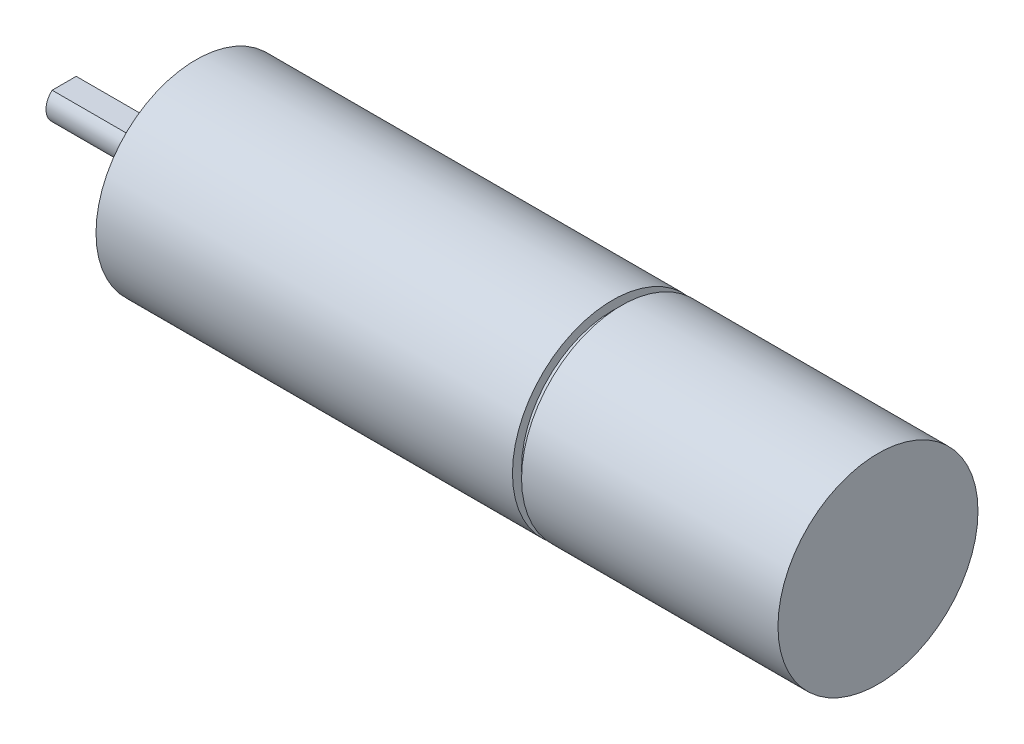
ISO-10303-21;
HEADER;
FILE_DESCRIPTION(('STEP AP214'),'2;1');
FILE_NAME('part.step','',(''),(''),'','','');
FILE_SCHEMA(('AUTOMOTIVE_DESIGN { 1 0 10303 214 1 1 1 1 }'));
ENDSEC;
DATA;
#1=APPLICATION_CONTEXT('core data for automotive mechanical design processes');
#2=APPLICATION_PROTOCOL_DEFINITION('international standard','automotive_design',2000,#1);
#3=PRODUCT_CONTEXT('',#1,'mechanical');
#4=PRODUCT('Part','Part','',(#3));
#5=PRODUCT_RELATED_PRODUCT_CATEGORY('part','',(#4));
#6=PRODUCT_DEFINITION_FORMATION('','',#4);
#7=PRODUCT_DEFINITION_CONTEXT('part definition',#1,'design');
#8=PRODUCT_DEFINITION('design','',#6,#7);
#9=PRODUCT_DEFINITION_SHAPE('','',#8);
#10=(LENGTH_UNIT() NAMED_UNIT(*) SI_UNIT(.MILLI.,.METRE.));
#11=(NAMED_UNIT(*) PLANE_ANGLE_UNIT() SI_UNIT($,.RADIAN.));
#12=(NAMED_UNIT(*) SI_UNIT($,.STERADIAN.) SOLID_ANGLE_UNIT());
#13=UNCERTAINTY_MEASURE_WITH_UNIT(LENGTH_MEASURE(1.E-05),#10,'distance_accuracy_value','');
#14=(GEOMETRIC_REPRESENTATION_CONTEXT(3) GLOBAL_UNCERTAINTY_ASSIGNED_CONTEXT((#13)) GLOBAL_UNIT_ASSIGNED_CONTEXT((#10,
#11,#12)) REPRESENTATION_CONTEXT('',''));
#15=CARTESIAN_POINT('',(0.,0.,0.));
#16=DIRECTION('',(0.,0.,1.));
#17=DIRECTION('',(1.,0.,0.));
#18=AXIS2_PLACEMENT_3D('',#15,#16,#17);
#19=CARTESIAN_POINT('',(29.2,0.,-11.));
#20=DIRECTION('',(1.,0.,0.));
#21=DIRECTION('',(0.,0.,-1.));
#22=AXIS2_PLACEMENT_3D('',#19,#20,#21);
#23=PLANE('',#22);
#24=CARTESIAN_POINT('',(29.2,0.,0.));
#25=DIRECTION('',(1.,0.,0.));
#26=DIRECTION('',(0.,0.,-1.));
#27=AXIS2_PLACEMENT_3D('',#24,#25,#26);
#28=CIRCLE('',#27,11.);
#29=CARTESIAN_POINT('',(29.2,0.,-11.));
#30=VERTEX_POINT('',#29);
#31=EDGE_CURVE('E37',#30,#30,#28,.T.);
#32=ORIENTED_EDGE('',*,*,#31,.T.);
#33=EDGE_LOOP('',(#32));
#34=FACE_BOUND('',#33,.T.);
#35=ADVANCED_FACE('F30',(#34),#23,.T.);
#36=CARTESIAN_POINT('',(0.,0.,0.));
#37=DIRECTION('',(1.,0.,0.));
#38=DIRECTION('',(0.,0.,-1.));
#39=AXIS2_PLACEMENT_3D('',#36,#37,#38);
#40=CYLINDRICAL_SURFACE('',#39,11.);
#41=CARTESIAN_POINT('',(1.,0.,0.));
#42=DIRECTION('',(1.,0.,0.));
#43=DIRECTION('',(0.,0.,-1.));
#44=AXIS2_PLACEMENT_3D('',#41,#42,#43);
#45=CIRCLE('',#44,11.);
#46=CARTESIAN_POINT('',(1.,0.,-11.));
#47=VERTEX_POINT('',#46);
#48=EDGE_CURVE('E122',#47,#47,#45,.T.);
#49=ORIENTED_EDGE('',*,*,#48,.T.);
#50=EDGE_LOOP('',(#49));
#51=FACE_BOUND('',#50,.T.);
#52=ORIENTED_EDGE('',*,*,#31,.F.);
#53=EDGE_LOOP('',(#52));
#54=FACE_BOUND('',#53,.T.);
#55=ADVANCED_FACE('F128',(#51,#54),#40,.T.);
#56=CARTESIAN_POINT('',(1.,0.,-10.));
#57=DIRECTION('',(-1.,0.,0.));
#58=DIRECTION('',(0.,0.,1.));
#59=AXIS2_PLACEMENT_3D('',#56,#57,#58);
#60=PLANE('',#59);
#61=CARTESIAN_POINT('',(1.,0.,0.));
#62=DIRECTION('',(1.,0.,0.));
#63=DIRECTION('',(0.,0.,-1.));
#64=AXIS2_PLACEMENT_3D('',#61,#62,#63);
#65=CIRCLE('',#64,10.);
#66=CARTESIAN_POINT('',(1.,0.,-10.));
#67=VERTEX_POINT('',#66);
#68=EDGE_CURVE('E119',#67,#67,#65,.T.);
#69=ORIENTED_EDGE('',*,*,#68,.T.);
#70=EDGE_LOOP('',(#69));
#71=FACE_BOUND('',#70,.T.);
#72=ORIENTED_EDGE('',*,*,#48,.F.);
#73=EDGE_LOOP('',(#72));
#74=FACE_BOUND('',#73,.T.);
#75=ADVANCED_FACE('F130',(#71,#74),#60,.T.);
#76=CARTESIAN_POINT('',(0.,0.,0.));
#77=DIRECTION('',(1.,0.,0.));
#78=DIRECTION('',(0.,0.,-1.));
#79=AXIS2_PLACEMENT_3D('',#76,#77,#78);
#80=CYLINDRICAL_SURFACE('',#79,10.);
#81=CARTESIAN_POINT('',(0.,0.,0.));
#82=DIRECTION('',(1.,0.,0.));
#83=DIRECTION('',(0.,0.,-1.));
#84=AXIS2_PLACEMENT_3D('',#81,#82,#83);
#85=CIRCLE('',#84,10.);
#86=CARTESIAN_POINT('',(0.,0.,-10.));
#87=VERTEX_POINT('',#86);
#88=EDGE_CURVE('E116',#87,#87,#85,.T.);
#89=ORIENTED_EDGE('',*,*,#88,.T.);
#90=EDGE_LOOP('',(#89));
#91=FACE_BOUND('',#90,.T.);
#92=ORIENTED_EDGE('',*,*,#68,.F.);
#93=EDGE_LOOP('',(#92));
#94=FACE_BOUND('',#93,.T.);
#95=ADVANCED_FACE('F136',(#91,#94),#80,.T.);
#96=CARTESIAN_POINT('',(0.,0.,-11.));
#97=DIRECTION('',(1.,0.,0.));
#98=DIRECTION('',(0.,0.,-1.));
#99=AXIS2_PLACEMENT_3D('',#96,#97,#98);
#100=PLANE('',#99);
#101=CARTESIAN_POINT('',(0.,0.,0.));
#102=DIRECTION('',(1.,0.,0.));
#103=DIRECTION('',(0.,0.,-1.));
#104=AXIS2_PLACEMENT_3D('',#101,#102,#103);
#105=CIRCLE('',#104,11.);
#106=CARTESIAN_POINT('',(0.,0.,-11.));
#107=VERTEX_POINT('',#106);
#108=EDGE_CURVE('E113',#107,#107,#105,.T.);
#109=ORIENTED_EDGE('',*,*,#108,.T.);
#110=EDGE_LOOP('',(#109));
#111=FACE_BOUND('',#110,.T.);
#112=ORIENTED_EDGE('',*,*,#88,.F.);
#113=EDGE_LOOP('',(#112));
#114=FACE_BOUND('',#113,.T.);
#115=ADVANCED_FACE('F142',(#111,#114),#100,.T.);
#116=CARTESIAN_POINT('',(0.,0.,0.));
#117=DIRECTION('',(1.,0.,0.));
#118=DIRECTION('',(0.,0.,-1.));
#119=AXIS2_PLACEMENT_3D('',#116,#117,#118);
#120=CYLINDRICAL_SURFACE('',#119,11.);
#121=CARTESIAN_POINT('',(-45.8,0.,0.));
#122=DIRECTION('',(1.,0.,0.));
#123=DIRECTION('',(0.,0.,-1.));
#124=AXIS2_PLACEMENT_3D('',#121,#122,#123);
#125=CIRCLE('',#124,11.);
#126=CARTESIAN_POINT('',(-45.8,0.,-11.));
#127=VERTEX_POINT('',#126);
#128=EDGE_CURVE('E110',#127,#127,#125,.T.);
#129=ORIENTED_EDGE('',*,*,#128,.T.);
#130=EDGE_LOOP('',(#129));
#131=FACE_BOUND('',#130,.T.);
#132=ORIENTED_EDGE('',*,*,#108,.F.);
#133=EDGE_LOOP('',(#132));
#134=FACE_BOUND('',#133,.T.);
#135=ADVANCED_FACE('F146',(#131,#134),#120,.T.);
#136=CARTESIAN_POINT('',(-45.8,0.,-4.99999999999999));
#137=DIRECTION('',(-1.,0.,0.));
#138=DIRECTION('',(0.,0.,1.));
#139=AXIS2_PLACEMENT_3D('',#136,#137,#138);
#140=PLANE('',#139);
#141=CARTESIAN_POINT('',(-45.8,7.,0.));
#142=DIRECTION('',(-1.,0.,0.));
#143=DIRECTION('',(0.,0.,1.));
#144=AXIS2_PLACEMENT_3D('',#141,#142,#143);
#145=CIRCLE('',#144,1.025);
#146=CARTESIAN_POINT('',(-45.8,7.,1.025));
#147=VERTEX_POINT('',#146);
#148=EDGE_CURVE('E70',#147,#147,#145,.T.);
#149=ORIENTED_EDGE('',*,*,#148,.F.);
#150=EDGE_LOOP('',(#149));
#151=FACE_BOUND('',#150,.T.);
#152=CARTESIAN_POINT('',(-45.8,-3.50000000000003,6.06217782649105));
#153=DIRECTION('',(-1.,0.,0.));
#154=DIRECTION('',(0.,0.,1.));
#155=AXIS2_PLACEMENT_3D('',#152,#153,#154);
#156=CIRCLE('',#155,1.025);
#157=CARTESIAN_POINT('',(-45.8,-3.50000000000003,7.08717782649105));
#158=VERTEX_POINT('',#157);
#159=EDGE_CURVE('E78',#158,#158,#156,.T.);
#160=ORIENTED_EDGE('',*,*,#159,.F.);
#161=EDGE_LOOP('',(#160));
#162=FACE_BOUND('',#161,.T.);
#163=CARTESIAN_POINT('',(-45.8,-3.50000000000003,-6.06217782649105));
#164=DIRECTION('',(-1.,0.,0.));
#165=DIRECTION('',(0.,0.,1.));
#166=AXIS2_PLACEMENT_3D('',#163,#164,#165);
#167=CIRCLE('',#166,1.025);
#168=CARTESIAN_POINT('',(-45.8,-3.50000000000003,-5.03717782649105));
#169=VERTEX_POINT('',#168);
#170=EDGE_CURVE('E84',#169,#169,#167,.T.);
#171=ORIENTED_EDGE('',*,*,#170,.F.);
#172=EDGE_LOOP('',(#171));
#173=FACE_BOUND('',#172,.T.);
#174=CARTESIAN_POINT('',(-45.8,0.,0.));
#175=DIRECTION('',(1.,0.,0.));
#176=DIRECTION('',(0.,0.,-1.));
#177=AXIS2_PLACEMENT_3D('',#174,#175,#176);
#178=CIRCLE('',#177,4.99999999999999);
#179=CARTESIAN_POINT('',(-45.8,0.,-4.99999999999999));
#180=VERTEX_POINT('',#179);
#181=EDGE_CURVE('E107',#180,#180,#178,.T.);
#182=ORIENTED_EDGE('',*,*,#181,.T.);
#183=EDGE_LOOP('',(#182));
#184=FACE_BOUND('',#183,.T.);
#185=ORIENTED_EDGE('',*,*,#128,.F.);
#186=EDGE_LOOP('',(#185));
#187=FACE_BOUND('',#186,.T.);
#188=ADVANCED_FACE('F150',(#151,#162,#173,#184,#187),#140,.T.);
#189=CARTESIAN_POINT('',(0.,0.,0.));
#190=DIRECTION('',(1.,0.,0.));
#191=DIRECTION('',(0.,0.,-1.));
#192=AXIS2_PLACEMENT_3D('',#189,#190,#191);
#193=CYLINDRICAL_SURFACE('',#192,4.99999999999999);
#194=CARTESIAN_POINT('',(-47.1,0.,0.));
#195=DIRECTION('',(1.,0.,0.));
#196=DIRECTION('',(0.,0.,-1.));
#197=AXIS2_PLACEMENT_3D('',#194,#195,#196);
#198=CIRCLE('',#197,4.99999999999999);
#199=CARTESIAN_POINT('',(-47.1,0.,-4.99999999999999));
#200=VERTEX_POINT('',#199);
#201=EDGE_CURVE('E104',#200,#200,#198,.T.);
#202=ORIENTED_EDGE('',*,*,#201,.T.);
#203=EDGE_LOOP('',(#202));
#204=FACE_BOUND('',#203,.T.);
#205=ORIENTED_EDGE('',*,*,#181,.F.);
#206=EDGE_LOOP('',(#205));
#207=FACE_BOUND('',#206,.T.);
#208=ADVANCED_FACE('F154',(#204,#207),#193,.T.);
#209=CARTESIAN_POINT('',(-47.1,0.,-3.49999999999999));
#210=DIRECTION('',(-1.,0.,0.));
#211=DIRECTION('',(0.,0.,1.));
#212=AXIS2_PLACEMENT_3D('',#209,#210,#211);
#213=PLANE('',#212);
#214=CARTESIAN_POINT('',(-47.1,0.,0.));
#215=DIRECTION('',(1.,0.,0.));
#216=DIRECTION('',(0.,0.,-1.));
#217=AXIS2_PLACEMENT_3D('',#214,#215,#216);
#218=CIRCLE('',#217,3.49999999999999);
#219=CARTESIAN_POINT('',(-47.1,0.,-3.49999999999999));
#220=VERTEX_POINT('',#219);
#221=EDGE_CURVE('E101',#220,#220,#218,.T.);
#222=ORIENTED_EDGE('',*,*,#221,.T.);
#223=EDGE_LOOP('',(#222));
#224=FACE_BOUND('',#223,.T.);
#225=ORIENTED_EDGE('',*,*,#201,.F.);
#226=EDGE_LOOP('',(#225));
#227=FACE_BOUND('',#226,.T.);
#228=ADVANCED_FACE('F158',(#224,#227),#213,.T.);
#229=CARTESIAN_POINT('',(0.,0.,0.));
#230=DIRECTION('',(1.,0.,0.));
#231=DIRECTION('',(0.,0.,-1.));
#232=AXIS2_PLACEMENT_3D('',#229,#230,#231);
#233=CYLINDRICAL_SURFACE('',#232,3.49999999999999);
#234=CARTESIAN_POINT('',(-48.95,0.,0.));
#235=DIRECTION('',(1.,0.,0.));
#236=DIRECTION('',(0.,0.,-1.));
#237=AXIS2_PLACEMENT_3D('',#234,#235,#236);
#238=CIRCLE('',#237,3.49999999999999);
#239=CARTESIAN_POINT('',(-48.95,0.,-3.49999999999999));
#240=VERTEX_POINT('',#239);
#241=EDGE_CURVE('E98',#240,#240,#238,.T.);
#242=ORIENTED_EDGE('',*,*,#241,.T.);
#243=EDGE_LOOP('',(#242));
#244=FACE_BOUND('',#243,.T.);
#245=ORIENTED_EDGE('',*,*,#221,.F.);
#246=EDGE_LOOP('',(#245));
#247=FACE_BOUND('',#246,.T.);
#248=ADVANCED_FACE('F162',(#244,#247),#233,.T.);
#249=CARTESIAN_POINT('',(-48.95,0.,-1.99999999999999));
#250=DIRECTION('',(-1.,0.,0.));
#251=DIRECTION('',(0.,0.,1.));
#252=AXIS2_PLACEMENT_3D('',#249,#250,#251);
#253=PLANE('',#252);
#254=CARTESIAN_POINT('',(-48.95,0.,0.));
#255=DIRECTION('',(1.,0.,0.));
#256=DIRECTION('',(0.,0.,-1.));
#257=AXIS2_PLACEMENT_3D('',#254,#255,#256);
#258=CIRCLE('',#257,1.99999999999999);
#259=CARTESIAN_POINT('',(-48.95,1.5,1.32287565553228));
#260=VERTEX_POINT('',#259);
#261=CARTESIAN_POINT('',(-48.95,1.5,-1.32287565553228));
#262=VERTEX_POINT('',#261);
#263=EDGE_CURVE('E95',#260,#262,#258,.T.);
#264=ORIENTED_EDGE('',*,*,#263,.T.);
#265=DIRECTION('',(0.,0.,-1.));
#266=VECTOR('',#265,1.);
#267=CARTESIAN_POINT('',(-48.95,1.5,-4.48883161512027));
#268=LINE('',#267,#266);
#269=EDGE_CURVE('E87',#260,#262,#268,.T.);
#270=ORIENTED_EDGE('',*,*,#269,.F.);
#271=EDGE_LOOP('',(#264,#270));
#272=FACE_BOUND('',#271,.T.);
#273=ORIENTED_EDGE('',*,*,#241,.F.);
#274=EDGE_LOOP('',(#273));
#275=FACE_BOUND('',#274,.T.);
#276=ADVANCED_FACE('F166',(#272,#275),#253,.T.);
#277=CARTESIAN_POINT('',(0.,0.,0.));
#278=DIRECTION('',(1.,0.,0.));
#279=DIRECTION('',(0.,0.,-1.));
#280=AXIS2_PLACEMENT_3D('',#277,#278,#279);
#281=CYLINDRICAL_SURFACE('',#280,1.99999999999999);
#282=DIRECTION('',(1.,0.,0.));
#283=VECTOR('',#282,1.);
#284=CARTESIAN_POINT('',(0.,1.5,-1.32287565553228));
#285=LINE('',#284,#283);
#286=CARTESIAN_POINT('',(-60.3,1.5,-1.32287565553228));
#287=VERTEX_POINT('',#286);
#288=EDGE_CURVE('E43',#262,#287,#285,.F.);
#289=ORIENTED_EDGE('',*,*,#288,.F.);
#290=ORIENTED_EDGE('',*,*,#263,.F.);
#291=DIRECTION('',(1.,0.,0.));
#292=VECTOR('',#291,1.);
#293=CARTESIAN_POINT('',(0.,1.5,1.32287565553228));
#294=LINE('',#293,#292);
#295=CARTESIAN_POINT('',(-60.3,1.5,1.32287565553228));
#296=VERTEX_POINT('',#295);
#297=EDGE_CURVE('E89',#296,#260,#294,.T.);
#298=ORIENTED_EDGE('',*,*,#297,.F.);
#299=CARTESIAN_POINT('',(-60.3,0.,0.));
#300=DIRECTION('',(1.,0.,0.));
#301=DIRECTION('',(0.,0.,-1.));
#302=AXIS2_PLACEMENT_3D('',#299,#300,#301);
#303=CIRCLE('',#302,1.99999999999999);
#304=EDGE_CURVE('E92',#296,#287,#303,.T.);
#305=ORIENTED_EDGE('',*,*,#304,.T.);
#306=EDGE_LOOP('',(#289,#290,#298,#305));
#307=FACE_BOUND('',#306,.T.);
#308=ADVANCED_FACE('F170',(#307),#281,.T.);
#309=CARTESIAN_POINT('',(-60.3,0.,0.));
#310=DIRECTION('',(-1.,0.,0.));
#311=DIRECTION('',(0.,0.,1.));
#312=AXIS2_PLACEMENT_3D('',#309,#310,#311);
#313=PLANE('',#312);
#314=DIRECTION('',(0.,0.,1.));
#315=VECTOR('',#314,1.);
#316=CARTESIAN_POINT('',(-60.3,1.5,0.));
#317=LINE('',#316,#315);
#318=EDGE_CURVE('E11',#287,#296,#317,.T.);
#319=ORIENTED_EDGE('',*,*,#318,.F.);
#320=ORIENTED_EDGE('',*,*,#304,.F.);
#321=EDGE_LOOP('',(#319,#320));
#322=FACE_BOUND('',#321,.T.);
#323=ADVANCED_FACE('F174',(#322),#313,.T.);
#324=CARTESIAN_POINT('',(-37.8527635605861,1.5,-4.48883161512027));
#325=DIRECTION('',(0.,-1.,0.));
#326=DIRECTION('',(0.,0.,-1.));
#327=AXIS2_PLACEMENT_3D('',#324,#325,#326);
#328=PLANE('',#327);
#329=ORIENTED_EDGE('',*,*,#288,.T.);
#330=ORIENTED_EDGE('',*,*,#318,.T.);
#331=ORIENTED_EDGE('',*,*,#297,.T.);
#332=ORIENTED_EDGE('',*,*,#269,.T.);
#333=EDGE_LOOP('',(#329,#330,#331,#332));
#334=FACE_BOUND('',#333,.T.);
#335=ADVANCED_FACE('F178',(#334),#328,.F.);
#336=CARTESIAN_POINT('',(-45.8,-3.50000000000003,-6.06217782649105));
#337=DIRECTION('',(-1.,0.,0.));
#338=DIRECTION('',(0.,0.,1.));
#339=AXIS2_PLACEMENT_3D('',#336,#337,#338);
#340=CYLINDRICAL_SURFACE('',#339,1.025);
#341=CARTESIAN_POINT('',(-39.45,-3.50000000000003,-6.06217782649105));
#342=DIRECTION('',(-1.,0.,0.));
#343=DIRECTION('',(0.,0.,1.));
#344=AXIS2_PLACEMENT_3D('',#341,#342,#343);
#345=CIRCLE('',#344,1.025);
#346=CARTESIAN_POINT('',(-39.45,-3.50000000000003,-5.03717782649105));
#347=VERTEX_POINT('',#346);
#348=EDGE_CURVE('E81',#347,#347,#345,.T.);
#349=ORIENTED_EDGE('',*,*,#348,.F.);
#350=EDGE_LOOP('',(#349));
#351=FACE_BOUND('',#350,.T.);
#352=ORIENTED_EDGE('',*,*,#170,.T.);
#353=EDGE_LOOP('',(#352));
#354=FACE_BOUND('',#353,.T.);
#355=ADVANCED_FACE('F182',(#351,#354),#340,.F.);
#356=CARTESIAN_POINT('',(-39.45,-3.50000000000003,-6.06217782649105));
#357=DIRECTION('',(-1.,0.,0.));
#358=DIRECTION('',(0.,0.,1.));
#359=AXIS2_PLACEMENT_3D('',#356,#357,#358);
#360=CONICAL_SURFACE('',#359,1.025,1.02974425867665);
#361=CARTESIAN_POINT('',(-38.8341178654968,-3.50000000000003,-6.06217782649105));
#362=VERTEX_POINT('',#361);
#363=VERTEX_LOOP('',#362);
#364=FACE_BOUND('',#363,.T.);
#365=ORIENTED_EDGE('',*,*,#348,.T.);
#366=EDGE_LOOP('',(#365));
#367=FACE_BOUND('',#366,.T.);
#368=ADVANCED_FACE('F185',(#364,#367),#360,.F.);
#369=CARTESIAN_POINT('',(-45.8,-3.50000000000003,6.06217782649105));
#370=DIRECTION('',(-1.,0.,0.));
#371=DIRECTION('',(0.,0.,1.));
#372=AXIS2_PLACEMENT_3D('',#369,#370,#371);
#373=CYLINDRICAL_SURFACE('',#372,1.025);
#374=CARTESIAN_POINT('',(-39.45,-3.50000000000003,6.06217782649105));
#375=DIRECTION('',(-1.,0.,0.));
#376=DIRECTION('',(0.,0.,1.));
#377=AXIS2_PLACEMENT_3D('',#374,#375,#376);
#378=CIRCLE('',#377,1.025);
#379=CARTESIAN_POINT('',(-39.45,-3.50000000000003,7.08717782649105));
#380=VERTEX_POINT('',#379);
#381=EDGE_CURVE('E73',#380,#380,#378,.T.);
#382=ORIENTED_EDGE('',*,*,#381,.F.);
#383=EDGE_LOOP('',(#382));
#384=FACE_BOUND('',#383,.T.);
#385=ORIENTED_EDGE('',*,*,#159,.T.);
#386=EDGE_LOOP('',(#385));
#387=FACE_BOUND('',#386,.T.);
#388=ADVANCED_FACE('F189',(#384,#387),#373,.F.);
#389=CARTESIAN_POINT('',(-39.45,-3.50000000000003,6.06217782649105));
#390=DIRECTION('',(-1.,0.,0.));
#391=DIRECTION('',(0.,0.,1.));
#392=AXIS2_PLACEMENT_3D('',#389,#390,#391);
#393=CONICAL_SURFACE('',#392,1.025,1.02974425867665);
#394=CARTESIAN_POINT('',(-38.8341178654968,-3.50000000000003,6.06217782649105));
#395=VERTEX_POINT('',#394);
#396=VERTEX_LOOP('',#395);
#397=FACE_BOUND('',#396,.T.);
#398=ORIENTED_EDGE('',*,*,#381,.T.);
#399=EDGE_LOOP('',(#398));
#400=FACE_BOUND('',#399,.T.);
#401=ADVANCED_FACE('F193',(#397,#400),#393,.F.);
#402=CARTESIAN_POINT('',(-45.8,7.,0.));
#403=DIRECTION('',(-1.,0.,0.));
#404=DIRECTION('',(0.,0.,1.));
#405=AXIS2_PLACEMENT_3D('',#402,#403,#404);
#406=CYLINDRICAL_SURFACE('',#405,1.025);
#407=CARTESIAN_POINT('',(-39.45,7.,0.));
#408=DIRECTION('',(-1.,0.,0.));
#409=DIRECTION('',(0.,0.,1.));
#410=AXIS2_PLACEMENT_3D('',#407,#408,#409);
#411=CIRCLE('',#410,1.025);
#412=CARTESIAN_POINT('',(-39.45,7.,1.025));
#413=VERTEX_POINT('',#412);
#414=EDGE_CURVE('E68',#413,#413,#411,.T.);
#415=ORIENTED_EDGE('',*,*,#414,.F.);
#416=EDGE_LOOP('',(#415));
#417=FACE_BOUND('',#416,.T.);
#418=ORIENTED_EDGE('',*,*,#148,.T.);
#419=EDGE_LOOP('',(#418));
#420=FACE_BOUND('',#419,.T.);
#421=ADVANCED_FACE('F64',(#417,#420),#406,.F.);
#422=CARTESIAN_POINT('',(-39.45,7.,0.));
#423=DIRECTION('',(-1.,0.,0.));
#424=DIRECTION('',(0.,0.,1.));
#425=AXIS2_PLACEMENT_3D('',#422,#423,#424);
#426=CONICAL_SURFACE('',#425,1.025,1.02974425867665);
#427=CARTESIAN_POINT('',(-38.8341178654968,7.,0.));
#428=VERTEX_POINT('',#427);
#429=VERTEX_LOOP('',#428);
#430=FACE_BOUND('',#429,.T.);
#431=ORIENTED_EDGE('',*,*,#414,.T.);
#432=EDGE_LOOP('',(#431));
#433=FACE_BOUND('',#432,.T.);
#434=ADVANCED_FACE('F61',(#430,#433),#426,.F.);
#435=CLOSED_SHELL('',(#35,#55,#75,#95,#115,#135,#188,#208,#228,#248,#276,#308,#323,#335,#355,
#368,#388,#401,#421,#434));
#436=MANIFOLD_SOLID_BREP('B2',#435);
#437=ADVANCED_BREP_SHAPE_REPRESENTATION('',(#18,#436),#14);
#438=SHAPE_DEFINITION_REPRESENTATION(#9,#437);
ENDSEC;
END-ISO-10303-21;
